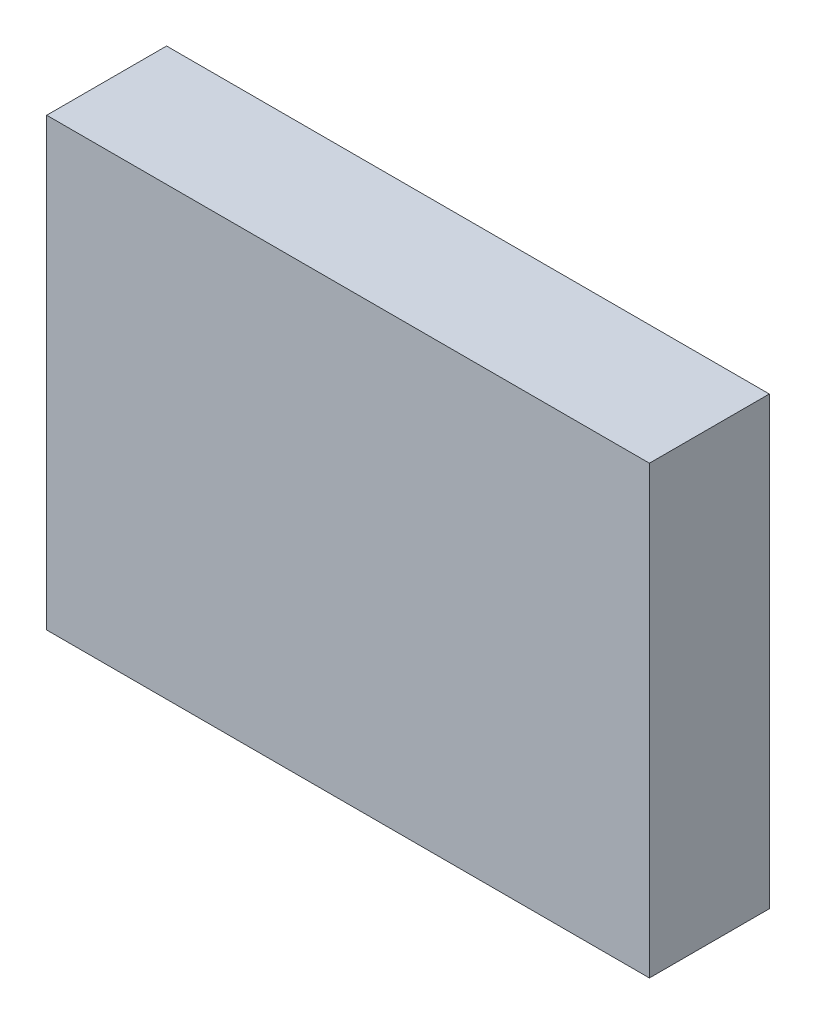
ISO-10303-21;
HEADER;
FILE_DESCRIPTION(('STEP AP214'),'2;1');
FILE_NAME('part.step','',(''),(''),'','','');
FILE_SCHEMA(('AUTOMOTIVE_DESIGN { 1 0 10303 214 1 1 1 1 }'));
ENDSEC;
DATA;
#1=APPLICATION_CONTEXT('core data for automotive mechanical design processes');
#2=APPLICATION_PROTOCOL_DEFINITION('international standard','automotive_design',2000,#1);
#3=PRODUCT_CONTEXT('',#1,'mechanical');
#4=PRODUCT('Part','Part','',(#3));
#5=PRODUCT_RELATED_PRODUCT_CATEGORY('part','',(#4));
#6=PRODUCT_DEFINITION_FORMATION('','',#4);
#7=PRODUCT_DEFINITION_CONTEXT('part definition',#1,'design');
#8=PRODUCT_DEFINITION('design','',#6,#7);
#9=PRODUCT_DEFINITION_SHAPE('','',#8);
#10=(LENGTH_UNIT() NAMED_UNIT(*) SI_UNIT(.MILLI.,.METRE.));
#11=(NAMED_UNIT(*) PLANE_ANGLE_UNIT() SI_UNIT($,.RADIAN.));
#12=(NAMED_UNIT(*) SI_UNIT($,.STERADIAN.) SOLID_ANGLE_UNIT());
#13=UNCERTAINTY_MEASURE_WITH_UNIT(LENGTH_MEASURE(1.E-05),#10,'distance_accuracy_value','');
#14=(GEOMETRIC_REPRESENTATION_CONTEXT(3) GLOBAL_UNCERTAINTY_ASSIGNED_CONTEXT((#13)) GLOBAL_UNIT_ASSIGNED_CONTEXT((#10,
#11,#12)) REPRESENTATION_CONTEXT('',''));
#15=CARTESIAN_POINT('',(0.,0.,0.));
#16=DIRECTION('',(0.,0.,1.));
#17=DIRECTION('',(1.,0.,0.));
#18=AXIS2_PLACEMENT_3D('',#15,#16,#17);
#19=CARTESIAN_POINT('',(-12.3961722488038,23.2428229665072,10.));
#20=DIRECTION('',(1.,0.,0.));
#21=DIRECTION('',(0.,0.,-1.));
#22=AXIS2_PLACEMENT_3D('',#19,#20,#21);
#23=PLANE('',#22);
#24=DIRECTION('',(0.,-1.,0.));
#25=VECTOR('',#24,1.);
#26=CARTESIAN_POINT('',(-12.3961722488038,23.2428229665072,0.));
#27=LINE('',#26,#25);
#28=CARTESIAN_POINT('',(-12.3961722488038,23.2428229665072,0.));
#29=VERTEX_POINT('',#28);
#30=CARTESIAN_POINT('',(-12.3961722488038,-13.9456937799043,0.));
#31=VERTEX_POINT('',#30);
#32=EDGE_CURVE('E98',#29,#31,#27,.T.);
#33=ORIENTED_EDGE('',*,*,#32,.T.);
#34=DIRECTION('',(0.,0.,-1.));
#35=VECTOR('',#34,1.);
#36=CARTESIAN_POINT('',(-12.3961722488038,-13.9456937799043,10.));
#37=LINE('',#36,#35);
#38=CARTESIAN_POINT('',(-12.3961722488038,-13.9456937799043,10.));
#39=VERTEX_POINT('',#38);
#40=EDGE_CURVE('E11',#39,#31,#37,.T.);
#41=ORIENTED_EDGE('',*,*,#40,.F.);
#42=DIRECTION('',(0.,-1.,0.));
#43=VECTOR('',#42,1.);
#44=CARTESIAN_POINT('',(-12.3961722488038,23.2428229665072,10.));
#45=LINE('',#44,#43);
#46=CARTESIAN_POINT('',(-12.3961722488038,23.2428229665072,10.));
#47=VERTEX_POINT('',#46);
#48=EDGE_CURVE('E86',#47,#39,#45,.T.);
#49=ORIENTED_EDGE('',*,*,#48,.F.);
#50=DIRECTION('',(0.,0.,-1.));
#51=VECTOR('',#50,1.);
#52=CARTESIAN_POINT('',(-12.3961722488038,23.2428229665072,10.));
#53=LINE('',#52,#51);
#54=EDGE_CURVE('E94',#47,#29,#53,.T.);
#55=ORIENTED_EDGE('',*,*,#54,.T.);
#56=EDGE_LOOP('',(#33,#41,#49,#55));
#57=FACE_BOUND('',#56,.T.);
#58=ADVANCED_FACE('F35',(#57),#23,.F.);
#59=CARTESIAN_POINT('',(-12.3961722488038,-13.9456937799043,10.));
#60=DIRECTION('',(0.,1.,0.));
#61=DIRECTION('',(0.,0.,1.));
#62=AXIS2_PLACEMENT_3D('',#59,#60,#61);
#63=PLANE('',#62);
#64=DIRECTION('',(1.,0.,0.));
#65=VECTOR('',#64,1.);
#66=CARTESIAN_POINT('',(-12.3961722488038,-13.9456937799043,0.));
#67=LINE('',#66,#65);
#68=CARTESIAN_POINT('',(37.8771929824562,-13.9456937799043,0.));
#69=VERTEX_POINT('',#68);
#70=EDGE_CURVE('E90',#31,#69,#67,.T.);
#71=ORIENTED_EDGE('',*,*,#70,.T.);
#72=DIRECTION('',(0.,0.,-1.));
#73=VECTOR('',#72,1.);
#74=CARTESIAN_POINT('',(37.8771929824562,-13.9456937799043,10.));
#75=LINE('',#74,#73);
#76=CARTESIAN_POINT('',(37.8771929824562,-13.9456937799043,10.));
#77=VERTEX_POINT('',#76);
#78=EDGE_CURVE('E43',#77,#69,#75,.T.);
#79=ORIENTED_EDGE('',*,*,#78,.F.);
#80=DIRECTION('',(1.,0.,0.));
#81=VECTOR('',#80,1.);
#82=CARTESIAN_POINT('',(-12.3961722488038,-13.9456937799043,10.));
#83=LINE('',#82,#81);
#84=EDGE_CURVE('E81',#39,#77,#83,.T.);
#85=ORIENTED_EDGE('',*,*,#84,.F.);
#86=ORIENTED_EDGE('',*,*,#40,.T.);
#87=EDGE_LOOP('',(#71,#79,#85,#86));
#88=FACE_BOUND('',#87,.T.);
#89=ADVANCED_FACE('F89',(#88),#63,.F.);
#90=CARTESIAN_POINT('',(37.8771929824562,23.2428229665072,10.));
#91=DIRECTION('',(-1.,0.,0.));
#92=DIRECTION('',(0.,0.,1.));
#93=AXIS2_PLACEMENT_3D('',#90,#91,#92);
#94=PLANE('',#93);
#95=DIRECTION('',(0.,1.,0.));
#96=VECTOR('',#95,1.);
#97=CARTESIAN_POINT('',(37.8771929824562,23.2428229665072,0.));
#98=LINE('',#97,#96);
#99=CARTESIAN_POINT('',(37.8771929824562,23.2428229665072,0.));
#100=VERTEX_POINT('',#99);
#101=EDGE_CURVE('E68',#69,#100,#98,.T.);
#102=ORIENTED_EDGE('',*,*,#101,.T.);
#103=DIRECTION('',(0.,0.,-1.));
#104=VECTOR('',#103,1.);
#105=CARTESIAN_POINT('',(37.8771929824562,23.2428229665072,10.));
#106=LINE('',#105,#104);
#107=CARTESIAN_POINT('',(37.8771929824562,23.2428229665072,10.));
#108=VERTEX_POINT('',#107);
#109=EDGE_CURVE('E91',#108,#100,#106,.T.);
#110=ORIENTED_EDGE('',*,*,#109,.F.);
#111=DIRECTION('',(0.,1.,0.));
#112=VECTOR('',#111,1.);
#113=CARTESIAN_POINT('',(37.8771929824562,23.2428229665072,10.));
#114=LINE('',#113,#112);
#115=EDGE_CURVE('E84',#77,#108,#114,.T.);
#116=ORIENTED_EDGE('',*,*,#115,.F.);
#117=ORIENTED_EDGE('',*,*,#78,.T.);
#118=EDGE_LOOP('',(#102,#110,#116,#117));
#119=FACE_BOUND('',#118,.T.);
#120=ADVANCED_FACE('F92',(#119),#94,.F.);
#121=CARTESIAN_POINT('',(-12.3961722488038,23.2428229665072,10.));
#122=DIRECTION('',(0.,-1.,0.));
#123=DIRECTION('',(0.,0.,-1.));
#124=AXIS2_PLACEMENT_3D('',#121,#122,#123);
#125=PLANE('',#124);
#126=DIRECTION('',(-1.,0.,0.));
#127=VECTOR('',#126,1.);
#128=CARTESIAN_POINT('',(-12.3961722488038,23.2428229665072,0.));
#129=LINE('',#128,#127);
#130=EDGE_CURVE('E74',#100,#29,#129,.T.);
#131=ORIENTED_EDGE('',*,*,#130,.T.);
#132=ORIENTED_EDGE('',*,*,#54,.F.);
#133=DIRECTION('',(-1.,0.,0.));
#134=VECTOR('',#133,1.);
#135=CARTESIAN_POINT('',(-12.3961722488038,23.2428229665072,10.));
#136=LINE('',#135,#134);
#137=EDGE_CURVE('E51',#108,#47,#136,.T.);
#138=ORIENTED_EDGE('',*,*,#137,.F.);
#139=ORIENTED_EDGE('',*,*,#109,.T.);
#140=EDGE_LOOP('',(#131,#132,#138,#139));
#141=FACE_BOUND('',#140,.T.);
#142=ADVANCED_FACE('F105',(#141),#125,.F.);
#143=CARTESIAN_POINT('',(-12.3961722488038,-13.9456937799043,10.));
#144=DIRECTION('',(0.,0.,1.));
#145=DIRECTION('',(1.,0.,0.));
#146=AXIS2_PLACEMENT_3D('',#143,#144,#145);
#147=PLANE('',#146);
#148=ORIENTED_EDGE('',*,*,#48,.T.);
#149=ORIENTED_EDGE('',*,*,#84,.T.);
#150=ORIENTED_EDGE('',*,*,#115,.T.);
#151=ORIENTED_EDGE('',*,*,#137,.T.);
#152=EDGE_LOOP('',(#148,#149,#150,#151));
#153=FACE_BOUND('',#152,.T.);
#154=ADVANCED_FACE('F82',(#153),#147,.T.);
#155=CARTESIAN_POINT('',(-12.3961722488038,-13.9456937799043,0.));
#156=DIRECTION('',(0.,0.,1.));
#157=DIRECTION('',(1.,0.,0.));
#158=AXIS2_PLACEMENT_3D('',#155,#156,#157);
#159=PLANE('',#158);
#160=ORIENTED_EDGE('',*,*,#32,.F.);
#161=ORIENTED_EDGE('',*,*,#130,.F.);
#162=ORIENTED_EDGE('',*,*,#101,.F.);
#163=ORIENTED_EDGE('',*,*,#70,.F.);
#164=EDGE_LOOP('',(#160,#161,#162,#163));
#165=FACE_BOUND('',#164,.T.);
#166=ADVANCED_FACE('F108',(#165),#159,.F.);
#167=CLOSED_SHELL('',(#58,#89,#120,#142,#154,#166));
#168=MANIFOLD_SOLID_BREP('B2',#167);
#169=ADVANCED_BREP_SHAPE_REPRESENTATION('',(#18,#168),#14);
#170=SHAPE_DEFINITION_REPRESENTATION(#9,#169);
ENDSEC;
END-ISO-10303-21;
